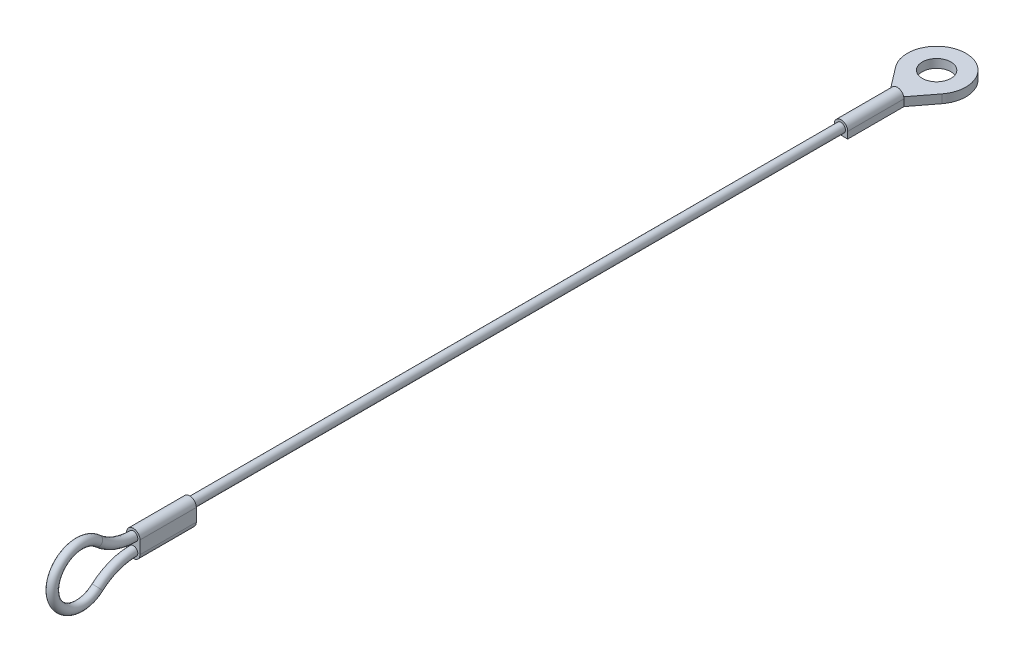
from build123d import *

# Parameters (mm, degrees)
SKETCH2_R           = 0.795
BOSS_EXTRUDE1_DEPTH = 10
BOSS_EXTRUDE2_DEPTH = 10
SKETCH5_R           = 2.54
BOSS_EXTRUDE3_DEPTH = 1.52


with BuildPart() as part:
    # Sweep1: sweep along a path in Sketch1
    with BuildLine(Plane(origin=(0, 0, 0), x_dir=(0, 0, -1), z_dir=(1, 0, 0))) as sweep1_path:
        Line((0, 0), (-125.8, 0))
        ThreePointArc((-125.8, 0), (-129.225492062, 0.631945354), (-132.2, 2.444582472))
        ThreePointArc((-132.2, 2.444582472), (-140.2, -1.133126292), (-132.2, -4.710835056))
        ThreePointArc((-132.2, -4.710835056), (-129.225492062, -2.898197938), (-125.8, -2.266252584))
    # Sketch2 → Sweep1 (sweep)
    with BuildSketch(Plane.XY):
        Circle(SKETCH2_R)
    sweep(path=sweep1_path.line)

    # Sketch3 → Boss-Extrude1 (add)
    with BuildSketch(Plane(origin=(0, 0, 125.8), x_dir=(-1, 0, 0), z_dir=(0, 0, -1))):
        with BuildLine():
            Line((1.195, 0), (1.195, -2.266252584))
            ThreePointArc((1.195, -2.266252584), (0, -3.461252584), (-1.195, -2.266252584))
            Line((-1.195, -2.266252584), (-1.195, 0))
            ThreePointArc((-1.195, 0), (0, 1.195), (1.195, 0))
        make_face()
    extrude(amount=BOSS_EXTRUDE1_DEPTH)

    # Sketch4 → Boss-Extrude2 (add)
    with BuildSketch(Plane(origin=(0, 0, 0), x_dir=(-1, 0, 0), z_dir=(0, 0, -1))):
        with BuildLine():
            Line((-1.195, 0), (-1.195, -1.195))
            Line((-1.195, -1.195), (0, -1.195))
            Line((0, -1.195), (1.195, -1.195))
            Line((1.195, -1.195), (1.195, 0))
            ThreePointArc((1.195, 0), (0, 1.195), (-1.195, 0))
        make_face()
    extrude(amount=BOSS_EXTRUDE2_DEPTH)

    # Sketch5 → Boss-Extrude3 (add)
    with BuildSketch(Plane.XZ.offset(1.195)):
        with BuildLine():
            Line((-1.195, -10), (1.195, -10))
            Line((1.195, -10), (4.132281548, -13.835150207))
            ThreePointArc((4.132281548, -13.835150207), (0, -22.205), (-4.132281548, -13.835150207))
            Line((-4.132281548, -13.835150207), (-1.195, -10))
        make_face()
        with Locations(Location((0, -17, 0), (0, 0, 270))):
            Circle(SKETCH5_R, mode=Mode.SUBTRACT)
    extrude(amount=-BOSS_EXTRUDE3_DEPTH)


solid = part.part
